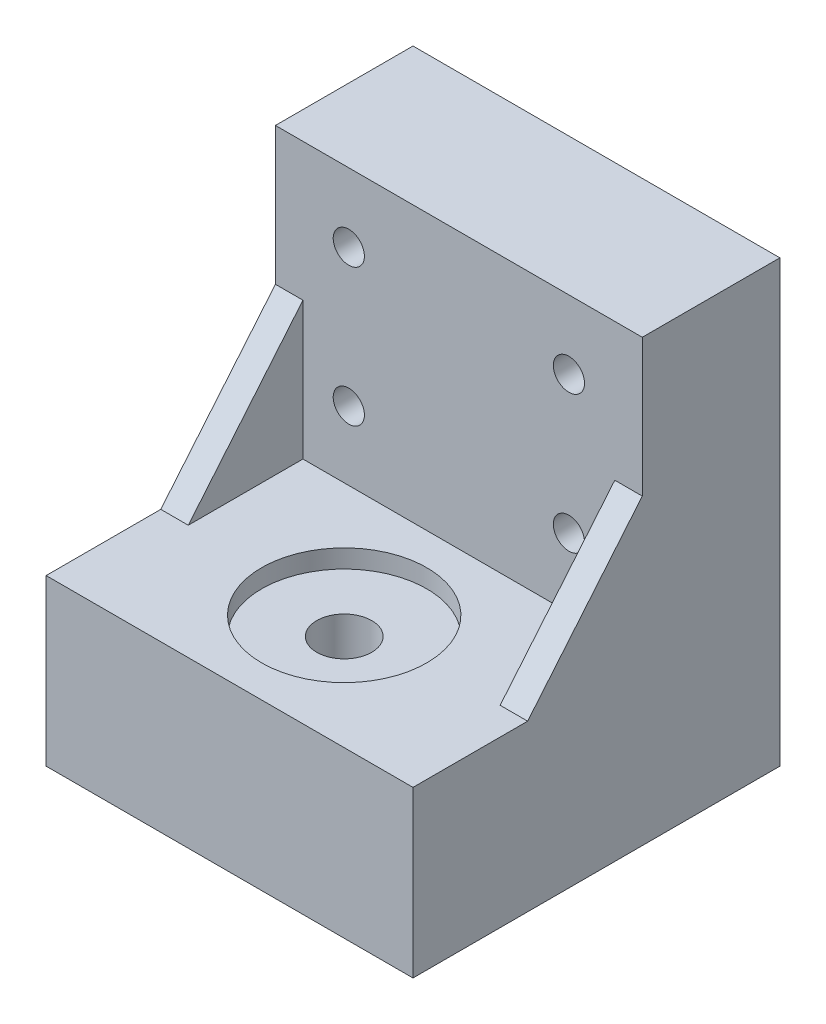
ISO-10303-21;
HEADER;
FILE_DESCRIPTION(('STEP AP214'),'2;1');
FILE_NAME('part.step','',(''),(''),'','','');
FILE_SCHEMA(('AUTOMOTIVE_DESIGN { 1 0 10303 214 1 1 1 1 }'));
ENDSEC;
DATA;
#1=APPLICATION_CONTEXT('core data for automotive mechanical design processes');
#2=APPLICATION_PROTOCOL_DEFINITION('international standard','automotive_design',2000,#1);
#3=PRODUCT_CONTEXT('',#1,'mechanical');
#4=PRODUCT('Part','Part','',(#3));
#5=PRODUCT_RELATED_PRODUCT_CATEGORY('part','',(#4));
#6=PRODUCT_DEFINITION_FORMATION('','',#4);
#7=PRODUCT_DEFINITION_CONTEXT('part definition',#1,'design');
#8=PRODUCT_DEFINITION('design','',#6,#7);
#9=PRODUCT_DEFINITION_SHAPE('','',#8);
#10=(LENGTH_UNIT() NAMED_UNIT(*) SI_UNIT(.MILLI.,.METRE.));
#11=(NAMED_UNIT(*) PLANE_ANGLE_UNIT() SI_UNIT($,.RADIAN.));
#12=(NAMED_UNIT(*) SI_UNIT($,.STERADIAN.) SOLID_ANGLE_UNIT());
#13=UNCERTAINTY_MEASURE_WITH_UNIT(LENGTH_MEASURE(1.E-05),#10,'distance_accuracy_value','');
#14=(GEOMETRIC_REPRESENTATION_CONTEXT(3) GLOBAL_UNCERTAINTY_ASSIGNED_CONTEXT((#13)) GLOBAL_UNIT_ASSIGNED_CONTEXT((#10,
#11,#12)) REPRESENTATION_CONTEXT('',''));
#15=CARTESIAN_POINT('',(0.,0.,0.));
#16=DIRECTION('',(0.,0.,1.));
#17=DIRECTION('',(1.,0.,0.));
#18=AXIS2_PLACEMENT_3D('',#15,#16,#17);
#19=CARTESIAN_POINT('',(0.,30.,-25.));
#20=DIRECTION('',(0.,0.,-1.));
#21=DIRECTION('',(-1.,0.,0.));
#22=AXIS2_PLACEMENT_3D('',#19,#20,#21);
#23=PLANE('',#22);
#24=CARTESIAN_POINT('',(32.,22.5,-25.));
#25=DIRECTION('',(0.,0.,1.));
#26=DIRECTION('',(1.,0.,0.));
#27=AXIS2_PLACEMENT_3D('',#24,#25,#26);
#28=CIRCLE('',#27,1.7);
#29=CARTESIAN_POINT('',(33.7,22.5,-25.));
#30=VERTEX_POINT('',#29);
#31=EDGE_CURVE('E174',#30,#30,#28,.T.);
#32=ORIENTED_EDGE('',*,*,#31,.F.);
#33=EDGE_LOOP('',(#32));
#34=FACE_BOUND('',#33,.T.);
#35=CARTESIAN_POINT('',(8.,22.5,-25.));
#36=DIRECTION('',(0.,0.,1.));
#37=DIRECTION('',(1.,0.,0.));
#38=AXIS2_PLACEMENT_3D('',#35,#36,#37);
#39=CIRCLE('',#38,1.7);
#40=CARTESIAN_POINT('',(9.7,22.5,-25.));
#41=VERTEX_POINT('',#40);
#42=EDGE_CURVE('E177',#41,#41,#39,.T.);
#43=ORIENTED_EDGE('',*,*,#42,.F.);
#44=EDGE_LOOP('',(#43));
#45=FACE_BOUND('',#44,.T.);
#46=CARTESIAN_POINT('',(8.,7.5,-25.));
#47=DIRECTION('',(0.,0.,1.));
#48=DIRECTION('',(1.,0.,0.));
#49=AXIS2_PLACEMENT_3D('',#46,#47,#48);
#50=CIRCLE('',#49,1.7);
#51=CARTESIAN_POINT('',(9.7,7.5,-25.));
#52=VERTEX_POINT('',#51);
#53=EDGE_CURVE('E275',#52,#52,#50,.T.);
#54=ORIENTED_EDGE('',*,*,#53,.F.);
#55=EDGE_LOOP('',(#54));
#56=FACE_BOUND('',#55,.T.);
#57=CARTESIAN_POINT('',(32.,7.5,-25.));
#58=DIRECTION('',(0.,0.,1.));
#59=DIRECTION('',(1.,0.,0.));
#60=AXIS2_PLACEMENT_3D('',#57,#58,#59);
#61=CIRCLE('',#60,1.7);
#62=CARTESIAN_POINT('',(33.7,7.5,-25.));
#63=VERTEX_POINT('',#62);
#64=EDGE_CURVE('E11',#63,#63,#61,.T.);
#65=ORIENTED_EDGE('',*,*,#64,.F.);
#66=EDGE_LOOP('',(#65));
#67=FACE_BOUND('',#66,.T.);
#68=DIRECTION('',(-1.,0.,0.));
#69=VECTOR('',#68,1.);
#70=CARTESIAN_POINT('',(3.,15.,-25.));
#71=LINE('',#70,#69);
#72=CARTESIAN_POINT('',(3.,15.,-25.));
#73=VERTEX_POINT('',#72);
#74=CARTESIAN_POINT('',(0.,15.,-25.));
#75=VERTEX_POINT('',#74);
#76=EDGE_CURVE('E134',#73,#75,#71,.T.);
#77=ORIENTED_EDGE('',*,*,#76,.F.);
#78=DIRECTION('',(0.,-1.,0.));
#79=VECTOR('',#78,1.);
#80=CARTESIAN_POINT('',(3.,0.,-25.));
#81=LINE('',#80,#79);
#82=CARTESIAN_POINT('',(3.,0.,-25.));
#83=VERTEX_POINT('',#82);
#84=EDGE_CURVE('E137',#73,#83,#81,.T.);
#85=ORIENTED_EDGE('',*,*,#84,.T.);
#86=DIRECTION('',(1.,0.,0.));
#87=VECTOR('',#86,1.);
#88=CARTESIAN_POINT('',(0.,0.,-25.));
#89=LINE('',#88,#87);
#90=CARTESIAN_POINT('',(37.,0.,-25.));
#91=VERTEX_POINT('',#90);
#92=EDGE_CURVE('E145',#83,#91,#89,.T.);
#93=ORIENTED_EDGE('',*,*,#92,.T.);
#94=DIRECTION('',(0.,-1.,0.));
#95=VECTOR('',#94,1.);
#96=CARTESIAN_POINT('',(37.,15.,-25.));
#97=LINE('',#96,#95);
#98=CARTESIAN_POINT('',(37.,15.,-25.));
#99=VERTEX_POINT('',#98);
#100=EDGE_CURVE('E152',#99,#91,#97,.T.);
#101=ORIENTED_EDGE('',*,*,#100,.F.);
#102=DIRECTION('',(1.,0.,0.));
#103=VECTOR('',#102,1.);
#104=CARTESIAN_POINT('',(37.,15.,-25.));
#105=LINE('',#104,#103);
#106=CARTESIAN_POINT('',(40.,15.,-25.));
#107=VERTEX_POINT('',#106);
#108=EDGE_CURVE('E161',#99,#107,#105,.T.);
#109=ORIENTED_EDGE('',*,*,#108,.T.);
#110=DIRECTION('',(0.,-1.,0.));
#111=VECTOR('',#110,1.);
#112=CARTESIAN_POINT('',(40.,30.,-25.));
#113=LINE('',#112,#111);
#114=CARTESIAN_POINT('',(40.,30.,-25.));
#115=VERTEX_POINT('',#114);
#116=EDGE_CURVE('E219',#115,#107,#113,.T.);
#117=ORIENTED_EDGE('',*,*,#116,.F.);
#118=DIRECTION('',(1.,0.,0.));
#119=VECTOR('',#118,1.);
#120=CARTESIAN_POINT('',(0.,30.,-25.));
#121=LINE('',#120,#119);
#122=CARTESIAN_POINT('',(0.,30.,-25.));
#123=VERTEX_POINT('',#122);
#124=EDGE_CURVE('E210',#123,#115,#121,.T.);
#125=ORIENTED_EDGE('',*,*,#124,.F.);
#126=DIRECTION('',(0.,-1.,0.));
#127=VECTOR('',#126,1.);
#128=CARTESIAN_POINT('',(0.,30.,-25.));
#129=LINE('',#128,#127);
#130=EDGE_CURVE('E221',#123,#75,#129,.T.);
#131=ORIENTED_EDGE('',*,*,#130,.T.);
#132=EDGE_LOOP('',(#77,#85,#93,#101,#109,#117,#125,#131));
#133=FACE_BOUND('',#132,.T.);
#134=ADVANCED_FACE('F44',(#34,#45,#56,#67,#133),#23,.F.);
#135=CARTESIAN_POINT('',(0.,0.,0.));
#136=DIRECTION('',(0.,-1.,0.));
#137=DIRECTION('',(0.,0.,-1.));
#138=AXIS2_PLACEMENT_3D('',#135,#136,#137);
#139=PLANE('',#138);
#140=CARTESIAN_POINT('',(20.,0.,-12.5));
#141=DIRECTION('',(0.,1.,0.));
#142=DIRECTION('',(0.,0.,1.));
#143=AXIS2_PLACEMENT_3D('',#140,#141,#142);
#144=CIRCLE('',#143,9.);
#145=CARTESIAN_POINT('',(20.,0.,-3.5));
#146=VERTEX_POINT('',#145);
#147=EDGE_CURVE('E195',#146,#146,#144,.T.);
#148=ORIENTED_EDGE('',*,*,#147,.F.);
#149=EDGE_LOOP('',(#148));
#150=FACE_BOUND('',#149,.T.);
#151=ORIENTED_EDGE('',*,*,#92,.F.);
#152=DIRECTION('',(0.,0.,1.));
#153=VECTOR('',#152,1.);
#154=CARTESIAN_POINT('',(3.,0.,-12.5));
#155=LINE('',#154,#153);
#156=CARTESIAN_POINT('',(3.,0.,-12.5));
#157=VERTEX_POINT('',#156);
#158=EDGE_CURVE('E62',#83,#157,#155,.T.);
#159=ORIENTED_EDGE('',*,*,#158,.T.);
#160=DIRECTION('',(-1.,0.,0.));
#161=VECTOR('',#160,1.);
#162=CARTESIAN_POINT('',(3.,0.,-12.5));
#163=LINE('',#162,#161);
#164=CARTESIAN_POINT('',(0.,0.,-12.5));
#165=VERTEX_POINT('',#164);
#166=EDGE_CURVE('E121',#157,#165,#163,.T.);
#167=ORIENTED_EDGE('',*,*,#166,.T.);
#168=DIRECTION('',(0.,0.,1.));
#169=VECTOR('',#168,1.);
#170=CARTESIAN_POINT('',(0.,0.,0.));
#171=LINE('',#170,#169);
#172=CARTESIAN_POINT('',(0.,0.,0.));
#173=VERTEX_POINT('',#172);
#174=EDGE_CURVE('E226',#165,#173,#171,.T.);
#175=ORIENTED_EDGE('',*,*,#174,.T.);
#176=DIRECTION('',(1.,0.,0.));
#177=VECTOR('',#176,1.);
#178=CARTESIAN_POINT('',(0.,0.,0.));
#179=LINE('',#178,#177);
#180=CARTESIAN_POINT('',(40.,0.,0.));
#181=VERTEX_POINT('',#180);
#182=EDGE_CURVE('E248',#173,#181,#179,.T.);
#183=ORIENTED_EDGE('',*,*,#182,.T.);
#184=DIRECTION('',(0.,0.,-1.));
#185=VECTOR('',#184,1.);
#186=CARTESIAN_POINT('',(40.,0.,0.));
#187=LINE('',#186,#185);
#188=CARTESIAN_POINT('',(40.,0.,-12.5));
#189=VERTEX_POINT('',#188);
#190=EDGE_CURVE('E234',#181,#189,#187,.T.);
#191=ORIENTED_EDGE('',*,*,#190,.T.);
#192=DIRECTION('',(1.,0.,0.));
#193=VECTOR('',#192,1.);
#194=CARTESIAN_POINT('',(37.,0.,-12.5));
#195=LINE('',#194,#193);
#196=CARTESIAN_POINT('',(37.,0.,-12.5));
#197=VERTEX_POINT('',#196);
#198=EDGE_CURVE('E166',#197,#189,#195,.T.);
#199=ORIENTED_EDGE('',*,*,#198,.F.);
#200=DIRECTION('',(0.,0.,1.));
#201=VECTOR('',#200,1.);
#202=CARTESIAN_POINT('',(37.,0.,-25.));
#203=LINE('',#202,#201);
#204=EDGE_CURVE('E157',#91,#197,#203,.T.);
#205=ORIENTED_EDGE('',*,*,#204,.F.);
#206=EDGE_LOOP('',(#151,#159,#167,#175,#183,#191,#199,#205));
#207=FACE_BOUND('',#206,.T.);
#208=ADVANCED_FACE('F138',(#150,#207),#139,.F.);
#209=CARTESIAN_POINT('',(32.,7.5,-40.));
#210=DIRECTION('',(0.,0.,1.));
#211=DIRECTION('',(1.,0.,0.));
#212=AXIS2_PLACEMENT_3D('',#209,#210,#211);
#213=CYLINDRICAL_SURFACE('',#212,1.7);
#214=CARTESIAN_POINT('',(32.,7.5,-40.));
#215=DIRECTION('',(0.,0.,1.));
#216=DIRECTION('',(1.,0.,0.));
#217=AXIS2_PLACEMENT_3D('',#214,#215,#216);
#218=CIRCLE('',#217,1.7);
#219=CARTESIAN_POINT('',(33.7,7.5,-40.));
#220=VERTEX_POINT('',#219);
#221=EDGE_CURVE('E53',#220,#220,#218,.T.);
#222=ORIENTED_EDGE('',*,*,#221,.F.);
#223=EDGE_LOOP('',(#222));
#224=FACE_BOUND('',#223,.T.);
#225=ORIENTED_EDGE('',*,*,#64,.T.);
#226=EDGE_LOOP('',(#225));
#227=FACE_BOUND('',#226,.T.);
#228=ADVANCED_FACE('F50',(#224,#227),#213,.F.);
#229=CARTESIAN_POINT('',(8.,7.5,-40.));
#230=DIRECTION('',(0.,0.,1.));
#231=DIRECTION('',(1.,0.,0.));
#232=AXIS2_PLACEMENT_3D('',#229,#230,#231);
#233=CYLINDRICAL_SURFACE('',#232,1.7);
#234=CARTESIAN_POINT('',(8.,7.5,-40.));
#235=DIRECTION('',(0.,0.,1.));
#236=DIRECTION('',(1.,0.,0.));
#237=AXIS2_PLACEMENT_3D('',#234,#235,#236);
#238=CIRCLE('',#237,1.7);
#239=CARTESIAN_POINT('',(9.7,7.5,-40.));
#240=VERTEX_POINT('',#239);
#241=EDGE_CURVE('E256',#240,#240,#238,.T.);
#242=ORIENTED_EDGE('',*,*,#241,.F.);
#243=EDGE_LOOP('',(#242));
#244=FACE_BOUND('',#243,.T.);
#245=ORIENTED_EDGE('',*,*,#53,.T.);
#246=EDGE_LOOP('',(#245));
#247=FACE_BOUND('',#246,.T.);
#248=ADVANCED_FACE('F284',(#244,#247),#233,.F.);
#249=CARTESIAN_POINT('',(0.,-18.,0.));
#250=DIRECTION('',(-1.,0.,0.));
#251=DIRECTION('',(0.,0.,1.));
#252=AXIS2_PLACEMENT_3D('',#249,#250,#251);
#253=PLANE('',#252);
#254=ORIENTED_EDGE('',*,*,#174,.F.);
#255=DIRECTION('',(0.,0.768221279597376,-0.64018439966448));
#256=VECTOR('',#255,1.);
#257=CARTESIAN_POINT('',(0.,15.,-25.));
#258=LINE('',#257,#256);
#259=EDGE_CURVE('E126',#165,#75,#258,.T.);
#260=ORIENTED_EDGE('',*,*,#259,.T.);
#261=ORIENTED_EDGE('',*,*,#130,.F.);
#262=DIRECTION('',(0.,0.,1.));
#263=VECTOR('',#262,1.);
#264=CARTESIAN_POINT('',(0.,30.,-40.));
#265=LINE('',#264,#263);
#266=CARTESIAN_POINT('',(0.,30.,-40.));
#267=VERTEX_POINT('',#266);
#268=EDGE_CURVE('E205',#267,#123,#265,.T.);
#269=ORIENTED_EDGE('',*,*,#268,.F.);
#270=DIRECTION('',(0.,1.,0.));
#271=VECTOR('',#270,1.);
#272=CARTESIAN_POINT('',(0.,-18.,-40.));
#273=LINE('',#272,#271);
#274=CARTESIAN_POINT('',(0.,-18.,-40.));
#275=VERTEX_POINT('',#274);
#276=EDGE_CURVE('E257',#275,#267,#273,.T.);
#277=ORIENTED_EDGE('',*,*,#276,.F.);
#278=DIRECTION('',(0.,0.,1.));
#279=VECTOR('',#278,1.);
#280=CARTESIAN_POINT('',(0.,-18.,0.));
#281=LINE('',#280,#279);
#282=CARTESIAN_POINT('',(0.,-18.,0.));
#283=VERTEX_POINT('',#282);
#284=EDGE_CURVE('E230',#275,#283,#281,.T.);
#285=ORIENTED_EDGE('',*,*,#284,.T.);
#286=DIRECTION('',(0.,1.,0.));
#287=VECTOR('',#286,1.);
#288=CARTESIAN_POINT('',(0.,-18.,0.));
#289=LINE('',#288,#287);
#290=EDGE_CURVE('E246',#283,#173,#289,.T.);
#291=ORIENTED_EDGE('',*,*,#290,.T.);
#292=EDGE_LOOP('',(#254,#260,#261,#269,#277,#285,#291));
#293=FACE_BOUND('',#292,.T.);
#294=ADVANCED_FACE('F292',(#293),#253,.T.);
#295=CARTESIAN_POINT('',(0.,-18.,-40.));
#296=DIRECTION('',(0.,0.,-1.));
#297=DIRECTION('',(-1.,0.,0.));
#298=AXIS2_PLACEMENT_3D('',#295,#296,#297);
#299=PLANE('',#298);
#300=CARTESIAN_POINT('',(32.,22.5,-40.));
#301=DIRECTION('',(0.,0.,1.));
#302=DIRECTION('',(1.,0.,0.));
#303=AXIS2_PLACEMENT_3D('',#300,#301,#302);
#304=CIRCLE('',#303,1.7);
#305=CARTESIAN_POINT('',(33.7,22.5,-40.));
#306=VERTEX_POINT('',#305);
#307=EDGE_CURVE('E171',#306,#306,#304,.T.);
#308=ORIENTED_EDGE('',*,*,#307,.T.);
#309=EDGE_LOOP('',(#308));
#310=FACE_BOUND('',#309,.T.);
#311=CARTESIAN_POINT('',(8.,22.5,-40.));
#312=DIRECTION('',(0.,0.,1.));
#313=DIRECTION('',(1.,0.,0.));
#314=AXIS2_PLACEMENT_3D('',#311,#312,#313);
#315=CIRCLE('',#314,1.7);
#316=CARTESIAN_POINT('',(9.7,22.5,-40.));
#317=VERTEX_POINT('',#316);
#318=EDGE_CURVE('E179',#317,#317,#315,.T.);
#319=ORIENTED_EDGE('',*,*,#318,.T.);
#320=EDGE_LOOP('',(#319));
#321=FACE_BOUND('',#320,.T.);
#322=ORIENTED_EDGE('',*,*,#276,.T.);
#323=DIRECTION('',(-1.,0.,0.));
#324=VECTOR('',#323,1.);
#325=CARTESIAN_POINT('',(0.,30.,-40.));
#326=LINE('',#325,#324);
#327=CARTESIAN_POINT('',(40.,30.,-40.));
#328=VERTEX_POINT('',#327);
#329=EDGE_CURVE('E211',#328,#267,#326,.T.);
#330=ORIENTED_EDGE('',*,*,#329,.F.);
#331=DIRECTION('',(0.,1.,0.));
#332=VECTOR('',#331,1.);
#333=CARTESIAN_POINT('',(40.,-18.,-40.));
#334=LINE('',#333,#332);
#335=CARTESIAN_POINT('',(40.,-18.,-40.));
#336=VERTEX_POINT('',#335);
#337=EDGE_CURVE('E258',#336,#328,#334,.T.);
#338=ORIENTED_EDGE('',*,*,#337,.F.);
#339=DIRECTION('',(-1.,0.,0.));
#340=VECTOR('',#339,1.);
#341=CARTESIAN_POINT('',(0.,-18.,-40.));
#342=LINE('',#341,#340);
#343=EDGE_CURVE('E245',#336,#275,#342,.T.);
#344=ORIENTED_EDGE('',*,*,#343,.T.);
#345=EDGE_LOOP('',(#322,#330,#338,#344));
#346=FACE_BOUND('',#345,.T.);
#347=ORIENTED_EDGE('',*,*,#241,.T.);
#348=EDGE_LOOP('',(#347));
#349=FACE_BOUND('',#348,.T.);
#350=ORIENTED_EDGE('',*,*,#221,.T.);
#351=EDGE_LOOP('',(#350));
#352=FACE_BOUND('',#351,.T.);
#353=ADVANCED_FACE('F276',(#310,#321,#346,#349,#352),#299,.T.);
#354=CARTESIAN_POINT('',(40.,-18.,0.));
#355=DIRECTION('',(1.,0.,0.));
#356=DIRECTION('',(0.,0.,-1.));
#357=AXIS2_PLACEMENT_3D('',#354,#355,#356);
#358=PLANE('',#357);
#359=DIRECTION('',(0.,-0.768221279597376,0.64018439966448));
#360=VECTOR('',#359,1.);
#361=CARTESIAN_POINT('',(40.,15.,-25.));
#362=LINE('',#361,#360);
#363=EDGE_CURVE('E68',#107,#189,#362,.T.);
#364=ORIENTED_EDGE('',*,*,#363,.T.);
#365=ORIENTED_EDGE('',*,*,#190,.F.);
#366=DIRECTION('',(0.,1.,0.));
#367=VECTOR('',#366,1.);
#368=CARTESIAN_POINT('',(40.,-18.,0.));
#369=LINE('',#368,#367);
#370=CARTESIAN_POINT('',(40.,-18.,0.));
#371=VERTEX_POINT('',#370);
#372=EDGE_CURVE('E264',#371,#181,#369,.T.);
#373=ORIENTED_EDGE('',*,*,#372,.F.);
#374=DIRECTION('',(0.,0.,-1.));
#375=VECTOR('',#374,1.);
#376=CARTESIAN_POINT('',(40.,-18.,0.));
#377=LINE('',#376,#375);
#378=EDGE_CURVE('E238',#371,#336,#377,.T.);
#379=ORIENTED_EDGE('',*,*,#378,.T.);
#380=ORIENTED_EDGE('',*,*,#337,.T.);
#381=DIRECTION('',(0.,0.,-1.));
#382=VECTOR('',#381,1.);
#383=CARTESIAN_POINT('',(40.,30.,-40.));
#384=LINE('',#383,#382);
#385=EDGE_CURVE('E208',#115,#328,#384,.T.);
#386=ORIENTED_EDGE('',*,*,#385,.F.);
#387=ORIENTED_EDGE('',*,*,#116,.T.);
#388=EDGE_LOOP('',(#364,#365,#373,#379,#380,#386,#387));
#389=FACE_BOUND('',#388,.T.);
#390=ADVANCED_FACE('F305',(#389),#358,.T.);
#391=CARTESIAN_POINT('',(0.,-18.,0.));
#392=DIRECTION('',(0.,0.,1.));
#393=DIRECTION('',(1.,0.,0.));
#394=AXIS2_PLACEMENT_3D('',#391,#392,#393);
#395=PLANE('',#394);
#396=ORIENTED_EDGE('',*,*,#182,.F.);
#397=ORIENTED_EDGE('',*,*,#290,.F.);
#398=DIRECTION('',(1.,0.,0.));
#399=VECTOR('',#398,1.);
#400=CARTESIAN_POINT('',(0.,-18.,0.));
#401=LINE('',#400,#399);
#402=EDGE_CURVE('E231',#283,#371,#401,.T.);
#403=ORIENTED_EDGE('',*,*,#402,.T.);
#404=ORIENTED_EDGE('',*,*,#372,.T.);
#405=EDGE_LOOP('',(#396,#397,#403,#404));
#406=FACE_BOUND('',#405,.T.);
#407=ADVANCED_FACE('F296',(#406),#395,.T.);
#408=CARTESIAN_POINT('',(0.,-18.,0.));
#409=DIRECTION('',(0.,-1.,0.));
#410=DIRECTION('',(0.,0.,-1.));
#411=AXIS2_PLACEMENT_3D('',#408,#409,#410);
#412=PLANE('',#411);
#413=CARTESIAN_POINT('',(20.,-18.,-12.5));
#414=DIRECTION('',(0.,1.,0.));
#415=DIRECTION('',(0.,0.,1.));
#416=AXIS2_PLACEMENT_3D('',#413,#414,#415);
#417=CIRCLE('',#416,3.);
#418=CARTESIAN_POINT('',(20.,-18.,-9.5));
#419=VERTEX_POINT('',#418);
#420=EDGE_CURVE('E189',#419,#419,#417,.T.);
#421=ORIENTED_EDGE('',*,*,#420,.T.);
#422=EDGE_LOOP('',(#421));
#423=FACE_BOUND('',#422,.T.);
#424=ORIENTED_EDGE('',*,*,#284,.F.);
#425=ORIENTED_EDGE('',*,*,#343,.F.);
#426=ORIENTED_EDGE('',*,*,#378,.F.);
#427=ORIENTED_EDGE('',*,*,#402,.F.);
#428=EDGE_LOOP('',(#424,#425,#426,#427));
#429=FACE_BOUND('',#428,.T.);
#430=ADVANCED_FACE('F345',(#423,#429),#412,.T.);
#431=CARTESIAN_POINT('',(0.,30.,0.));
#432=DIRECTION('',(0.,1.,0.));
#433=DIRECTION('',(0.,0.,1.));
#434=AXIS2_PLACEMENT_3D('',#431,#432,#433);
#435=PLANE('',#434);
#436=ORIENTED_EDGE('',*,*,#268,.T.);
#437=ORIENTED_EDGE('',*,*,#124,.T.);
#438=ORIENTED_EDGE('',*,*,#385,.T.);
#439=ORIENTED_EDGE('',*,*,#329,.T.);
#440=EDGE_LOOP('',(#436,#437,#438,#439));
#441=FACE_BOUND('',#440,.T.);
#442=ADVANCED_FACE('F339',(#441),#435,.T.);
#443=CARTESIAN_POINT('',(20.,-2.,-12.5));
#444=DIRECTION('',(0.,1.,0.));
#445=DIRECTION('',(0.,0.,1.));
#446=AXIS2_PLACEMENT_3D('',#443,#444,#445);
#447=CYLINDRICAL_SURFACE('',#446,9.);
#448=CARTESIAN_POINT('',(20.,-2.,-12.5));
#449=DIRECTION('',(0.,1.,0.));
#450=DIRECTION('',(0.,0.,1.));
#451=AXIS2_PLACEMENT_3D('',#448,#449,#450);
#452=CIRCLE('',#451,9.);
#453=CARTESIAN_POINT('',(20.,-2.,-3.5));
#454=VERTEX_POINT('',#453);
#455=EDGE_CURVE('E196',#454,#454,#452,.T.);
#456=ORIENTED_EDGE('',*,*,#455,.F.);
#457=EDGE_LOOP('',(#456));
#458=FACE_BOUND('',#457,.T.);
#459=ORIENTED_EDGE('',*,*,#147,.T.);
#460=EDGE_LOOP('',(#459));
#461=FACE_BOUND('',#460,.T.);
#462=ADVANCED_FACE('F333',(#458,#461),#447,.F.);
#463=CARTESIAN_POINT('',(20.,-2.,-12.5));
#464=DIRECTION('',(0.,1.,0.));
#465=DIRECTION('',(0.,0.,1.));
#466=AXIS2_PLACEMENT_3D('',#463,#464,#465);
#467=PLANE('',#466);
#468=CARTESIAN_POINT('',(20.,-2.,-12.5));
#469=DIRECTION('',(0.,1.,0.));
#470=DIRECTION('',(0.,0.,1.));
#471=AXIS2_PLACEMENT_3D('',#468,#469,#470);
#472=CIRCLE('',#471,3.);
#473=CARTESIAN_POINT('',(20.,-2.,-9.5));
#474=VERTEX_POINT('',#473);
#475=EDGE_CURVE('E183',#474,#474,#472,.T.);
#476=ORIENTED_EDGE('',*,*,#475,.F.);
#477=EDGE_LOOP('',(#476));
#478=FACE_BOUND('',#477,.T.);
#479=ORIENTED_EDGE('',*,*,#455,.T.);
#480=EDGE_LOOP('',(#479));
#481=FACE_BOUND('',#480,.T.);
#482=ADVANCED_FACE('F332',(#478,#481),#467,.T.);
#483=CARTESIAN_POINT('',(20.,-18.,-12.5));
#484=DIRECTION('',(0.,1.,0.));
#485=DIRECTION('',(0.,0.,1.));
#486=AXIS2_PLACEMENT_3D('',#483,#484,#485);
#487=CYLINDRICAL_SURFACE('',#486,3.);
#488=ORIENTED_EDGE('',*,*,#420,.F.);
#489=EDGE_LOOP('',(#488));
#490=FACE_BOUND('',#489,.T.);
#491=ORIENTED_EDGE('',*,*,#475,.T.);
#492=EDGE_LOOP('',(#491));
#493=FACE_BOUND('',#492,.T.);
#494=ADVANCED_FACE('F327',(#490,#493),#487,.F.);
#495=CARTESIAN_POINT('',(8.,22.5,-40.));
#496=DIRECTION('',(0.,0.,1.));
#497=DIRECTION('',(1.,0.,0.));
#498=AXIS2_PLACEMENT_3D('',#495,#496,#497);
#499=CYLINDRICAL_SURFACE('',#498,1.7);
#500=ORIENTED_EDGE('',*,*,#318,.F.);
#501=EDGE_LOOP('',(#500));
#502=FACE_BOUND('',#501,.T.);
#503=ORIENTED_EDGE('',*,*,#42,.T.);
#504=EDGE_LOOP('',(#503));
#505=FACE_BOUND('',#504,.T.);
#506=ADVANCED_FACE('F324',(#502,#505),#499,.F.);
#507=CARTESIAN_POINT('',(32.,22.5,-40.));
#508=DIRECTION('',(0.,0.,1.));
#509=DIRECTION('',(1.,0.,0.));
#510=AXIS2_PLACEMENT_3D('',#507,#508,#509);
#511=CYLINDRICAL_SURFACE('',#510,1.7);
#512=ORIENTED_EDGE('',*,*,#307,.F.);
#513=EDGE_LOOP('',(#512));
#514=FACE_BOUND('',#513,.T.);
#515=ORIENTED_EDGE('',*,*,#31,.T.);
#516=EDGE_LOOP('',(#515));
#517=FACE_BOUND('',#516,.T.);
#518=ADVANCED_FACE('F320',(#514,#517),#511,.F.);
#519=CARTESIAN_POINT('',(37.,15.,-25.));
#520=DIRECTION('',(0.,0.64018439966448,0.768221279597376));
#521=DIRECTION('',(0.,-0.768221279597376,0.64018439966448));
#522=AXIS2_PLACEMENT_3D('',#519,#520,#521);
#523=PLANE('',#522);
#524=ORIENTED_EDGE('',*,*,#363,.F.);
#525=ORIENTED_EDGE('',*,*,#108,.F.);
#526=DIRECTION('',(0.,-0.768221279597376,0.64018439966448));
#527=VECTOR('',#526,1.);
#528=CARTESIAN_POINT('',(37.,15.,-25.));
#529=LINE('',#528,#527);
#530=EDGE_CURVE('E156',#99,#197,#529,.T.);
#531=ORIENTED_EDGE('',*,*,#530,.T.);
#532=ORIENTED_EDGE('',*,*,#198,.T.);
#533=EDGE_LOOP('',(#524,#525,#531,#532));
#534=FACE_BOUND('',#533,.T.);
#535=ADVANCED_FACE('F310',(#534),#523,.T.);
#536=CARTESIAN_POINT('',(37.,0.,0.));
#537=DIRECTION('',(-1.,0.,0.));
#538=DIRECTION('',(0.,0.,1.));
#539=AXIS2_PLACEMENT_3D('',#536,#537,#538);
#540=PLANE('',#539);
#541=ORIENTED_EDGE('',*,*,#100,.T.);
#542=ORIENTED_EDGE('',*,*,#204,.T.);
#543=ORIENTED_EDGE('',*,*,#530,.F.);
#544=EDGE_LOOP('',(#541,#542,#543));
#545=FACE_BOUND('',#544,.T.);
#546=ADVANCED_FACE('F307',(#545),#540,.T.);
#547=CARTESIAN_POINT('',(3.,15.,-25.));
#548=DIRECTION('',(0.,0.64018439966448,0.768221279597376));
#549=DIRECTION('',(0.,-0.768221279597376,0.64018439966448));
#550=AXIS2_PLACEMENT_3D('',#547,#548,#549);
#551=PLANE('',#550);
#552=ORIENTED_EDGE('',*,*,#259,.F.);
#553=ORIENTED_EDGE('',*,*,#166,.F.);
#554=DIRECTION('',(0.,0.768221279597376,-0.64018439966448));
#555=VECTOR('',#554,1.);
#556=CARTESIAN_POINT('',(3.,15.,-25.));
#557=LINE('',#556,#555);
#558=EDGE_CURVE('E127',#157,#73,#557,.T.);
#559=ORIENTED_EDGE('',*,*,#558,.T.);
#560=ORIENTED_EDGE('',*,*,#76,.T.);
#561=EDGE_LOOP('',(#552,#553,#559,#560));
#562=FACE_BOUND('',#561,.T.);
#563=ADVANCED_FACE('F123',(#562),#551,.T.);
#564=CARTESIAN_POINT('',(3.,0.,0.));
#565=DIRECTION('',(-1.,0.,0.));
#566=DIRECTION('',(0.,0.,1.));
#567=AXIS2_PLACEMENT_3D('',#564,#565,#566);
#568=PLANE('',#567);
#569=ORIENTED_EDGE('',*,*,#84,.F.);
#570=ORIENTED_EDGE('',*,*,#558,.F.);
#571=ORIENTED_EDGE('',*,*,#158,.F.);
#572=EDGE_LOOP('',(#569,#570,#571));
#573=FACE_BOUND('',#572,.T.);
#574=ADVANCED_FACE('F135',(#573),#568,.F.);
#575=CLOSED_SHELL('',(#134,#208,#228,#248,#294,#353,#390,#407,#430,#442,#462,#482,#494,#506,
#518,#535,#546,#563,#574));
#576=MANIFOLD_SOLID_BREP('B2',#575);
#577=ADVANCED_BREP_SHAPE_REPRESENTATION('',(#18,#576),#14);
#578=SHAPE_DEFINITION_REPRESENTATION(#9,#577);
ENDSEC;
END-ISO-10303-21;
